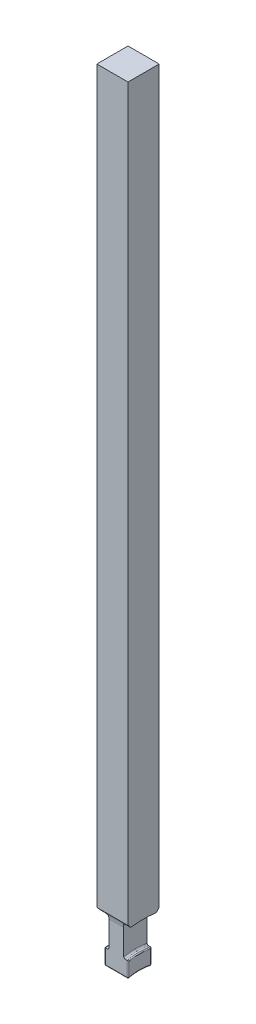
ISO-10303-21;
HEADER;
FILE_DESCRIPTION(('STEP AP214'),'2;1');
FILE_NAME('part.step','',(''),(''),'','','');
FILE_SCHEMA(('AUTOMOTIVE_DESIGN { 1 0 10303 214 1 1 1 1 }'));
ENDSEC;
DATA;
#1=APPLICATION_CONTEXT('core data for automotive mechanical design processes');
#2=APPLICATION_PROTOCOL_DEFINITION('international standard','automotive_design',2000,#1);
#3=PRODUCT_CONTEXT('',#1,'mechanical');
#4=PRODUCT('Part','Part','',(#3));
#5=PRODUCT_RELATED_PRODUCT_CATEGORY('part','',(#4));
#6=PRODUCT_DEFINITION_FORMATION('','',#4);
#7=PRODUCT_DEFINITION_CONTEXT('part definition',#1,'design');
#8=PRODUCT_DEFINITION('design','',#6,#7);
#9=PRODUCT_DEFINITION_SHAPE('','',#8);
#10=(LENGTH_UNIT() NAMED_UNIT(*) SI_UNIT(.MILLI.,.METRE.));
#11=(NAMED_UNIT(*) PLANE_ANGLE_UNIT() SI_UNIT($,.RADIAN.));
#12=(NAMED_UNIT(*) SI_UNIT($,.STERADIAN.) SOLID_ANGLE_UNIT());
#13=UNCERTAINTY_MEASURE_WITH_UNIT(LENGTH_MEASURE(1.E-05),#10,'distance_accuracy_value','');
#14=(GEOMETRIC_REPRESENTATION_CONTEXT(3) GLOBAL_UNCERTAINTY_ASSIGNED_CONTEXT((#13)) GLOBAL_UNIT_ASSIGNED_CONTEXT((#10,
#11,#12)) REPRESENTATION_CONTEXT('',''));
#15=CARTESIAN_POINT('',(0.,0.,0.));
#16=DIRECTION('',(0.,0.,1.));
#17=DIRECTION('',(1.,0.,0.));
#18=AXIS2_PLACEMENT_3D('',#15,#16,#17);
#19=CARTESIAN_POINT('',(4.,212.,4.));
#20=DIRECTION('',(0.,0.,-1.));
#21=DIRECTION('',(0.,1.,0.));
#22=AXIS2_PLACEMENT_3D('',#19,#20,#21);
#23=PLANE('',#22);
#24=DIRECTION('',(0.,-1.,0.));
#25=VECTOR('',#24,1.);
#26=CARTESIAN_POINT('',(-4.,212.,4.));
#27=LINE('',#26,#25);
#28=CARTESIAN_POINT('',(-4.,212.,4.));
#29=VERTEX_POINT('',#28);
#30=CARTESIAN_POINT('',(-4.00000000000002,24.5553873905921,3.99999999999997));
#31=VERTEX_POINT('',#30);
#32=EDGE_CURVE('E247',#29,#31,#27,.T.);
#33=ORIENTED_EDGE('',*,*,#32,.T.);
#34=DIRECTION('',(1.,0.,0.));
#35=VECTOR('',#34,1.);
#36=CARTESIAN_POINT('',(-4.00000000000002,24.5553873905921,3.99999999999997));
#37=LINE('',#36,#35);
#38=CARTESIAN_POINT('',(4.00000000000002,24.5553873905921,3.99999999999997));
#39=VERTEX_POINT('',#38);
#40=EDGE_CURVE('E382',#31,#39,#37,.T.);
#41=ORIENTED_EDGE('',*,*,#40,.T.);
#42=DIRECTION('',(0.,-1.,0.));
#43=VECTOR('',#42,1.);
#44=CARTESIAN_POINT('',(4.,212.,4.));
#45=LINE('',#44,#43);
#46=CARTESIAN_POINT('',(4.,212.,4.));
#47=VERTEX_POINT('',#46);
#48=EDGE_CURVE('E237',#47,#39,#45,.T.);
#49=ORIENTED_EDGE('',*,*,#48,.F.);
#50=DIRECTION('',(-1.,0.,0.));
#51=VECTOR('',#50,1.);
#52=CARTESIAN_POINT('',(4.,212.,4.));
#53=LINE('',#52,#51);
#54=EDGE_CURVE('E228',#47,#29,#53,.T.);
#55=ORIENTED_EDGE('',*,*,#54,.T.);
#56=EDGE_LOOP('',(#33,#41,#49,#55));
#57=FACE_BOUND('',#56,.T.);
#58=ADVANCED_FACE('F37',(#57),#23,.F.);
#59=CARTESIAN_POINT('',(4.,212.,-4.));
#60=DIRECTION('',(0.,0.,1.));
#61=DIRECTION('',(0.,-1.,0.));
#62=AXIS2_PLACEMENT_3D('',#59,#60,#61);
#63=PLANE('',#62);
#64=DIRECTION('',(0.,1.,0.));
#65=VECTOR('',#64,1.);
#66=CARTESIAN_POINT('',(4.,212.,-4.));
#67=LINE('',#66,#65);
#68=CARTESIAN_POINT('',(4.00000000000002,24.5553873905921,-4.00000000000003));
#69=VERTEX_POINT('',#68);
#70=CARTESIAN_POINT('',(4.,212.,-4.));
#71=VERTEX_POINT('',#70);
#72=EDGE_CURVE('E259',#69,#71,#67,.T.);
#73=ORIENTED_EDGE('',*,*,#72,.F.);
#74=DIRECTION('',(1.,0.,0.));
#75=VECTOR('',#74,1.);
#76=CARTESIAN_POINT('',(-4.00000000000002,24.5553873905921,-4.00000000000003));
#77=LINE('',#76,#75);
#78=CARTESIAN_POINT('',(-4.00000000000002,24.5553873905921,-4.00000000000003));
#79=VERTEX_POINT('',#78);
#80=EDGE_CURVE('E413',#69,#79,#77,.F.);
#81=ORIENTED_EDGE('',*,*,#80,.T.);
#82=DIRECTION('',(0.,1.,0.));
#83=VECTOR('',#82,1.);
#84=CARTESIAN_POINT('',(-4.,212.,-4.));
#85=LINE('',#84,#83);
#86=CARTESIAN_POINT('',(-4.,212.,-4.));
#87=VERTEX_POINT('',#86);
#88=EDGE_CURVE('E257',#79,#87,#85,.T.);
#89=ORIENTED_EDGE('',*,*,#88,.T.);
#90=DIRECTION('',(-1.,0.,0.));
#91=VECTOR('',#90,1.);
#92=CARTESIAN_POINT('',(4.,212.,-4.));
#93=LINE('',#92,#91);
#94=EDGE_CURVE('E260',#71,#87,#93,.T.);
#95=ORIENTED_EDGE('',*,*,#94,.F.);
#96=EDGE_LOOP('',(#73,#81,#89,#95));
#97=FACE_BOUND('',#96,.T.);
#98=ADVANCED_FACE('F374',(#97),#63,.F.);
#99=CARTESIAN_POINT('',(-4.,0.,0.));
#100=DIRECTION('',(-1.,0.,0.));
#101=DIRECTION('',(0.,0.,1.));
#102=AXIS2_PLACEMENT_3D('',#99,#100,#101);
#103=PLANE('',#102);
#104=CARTESIAN_POINT('',(-4.00000000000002,22.6124,-5.3876));
#105=DIRECTION('',(1.,0.,0.));
#106=DIRECTION('',(0.,0.,1.));
#107=AXIS2_PLACEMENT_3D('',#104,#105,#106);
#108=CIRCLE('',#107,2.3876);
#109=CARTESIAN_POINT('',(-4.00000000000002,23.7719741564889,-3.3004915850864));
#110=VERTEX_POINT('',#109);
#111=EDGE_CURVE('E439',#79,#110,#108,.T.);
#112=ORIENTED_EDGE('',*,*,#111,.T.);
#113=CARTESIAN_POINT('',(-4.00000000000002,0.,0.));
#114=DIRECTION('',(-1.,0.,0.));
#115=DIRECTION('',(0.,0.,1.));
#116=AXIS2_PLACEMENT_3D('',#113,#114,#115);
#117=CIRCLE('',#116,24.);
#118=CARTESIAN_POINT('',(-4.00000000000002,23.7719741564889,3.3004915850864));
#119=VERTEX_POINT('',#118);
#120=EDGE_CURVE('E244',#119,#110,#117,.T.);
#121=ORIENTED_EDGE('',*,*,#120,.F.);
#122=CARTESIAN_POINT('',(-4.00000000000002,22.6124,5.3876));
#123=DIRECTION('',(1.,0.,0.));
#124=DIRECTION('',(0.,0.,-1.));
#125=AXIS2_PLACEMENT_3D('',#122,#123,#124);
#126=CIRCLE('',#125,2.3876);
#127=EDGE_CURVE('E238',#119,#31,#126,.T.);
#128=ORIENTED_EDGE('',*,*,#127,.T.);
#129=ORIENTED_EDGE('',*,*,#32,.F.);
#130=DIRECTION('',(0.,0.,1.));
#131=VECTOR('',#130,1.);
#132=CARTESIAN_POINT('',(-4.,212.,4.));
#133=LINE('',#132,#131);
#134=EDGE_CURVE('E243',#87,#29,#133,.T.);
#135=ORIENTED_EDGE('',*,*,#134,.F.);
#136=ORIENTED_EDGE('',*,*,#88,.F.);
#137=EDGE_LOOP('',(#112,#121,#128,#129,#135,#136));
#138=FACE_BOUND('',#137,.T.);
#139=ADVANCED_FACE('F371',(#138),#103,.T.);
#140=CARTESIAN_POINT('',(4.,212.,4.));
#141=DIRECTION('',(0.,-1.,0.));
#142=DIRECTION('',(0.,0.,-1.));
#143=AXIS2_PLACEMENT_3D('',#140,#141,#142);
#144=PLANE('',#143);
#145=ORIENTED_EDGE('',*,*,#134,.T.);
#146=ORIENTED_EDGE('',*,*,#54,.F.);
#147=DIRECTION('',(0.,0.,1.));
#148=VECTOR('',#147,1.);
#149=CARTESIAN_POINT('',(4.,212.,4.));
#150=LINE('',#149,#148);
#151=EDGE_CURVE('E255',#71,#47,#150,.T.);
#152=ORIENTED_EDGE('',*,*,#151,.F.);
#153=ORIENTED_EDGE('',*,*,#94,.T.);
#154=EDGE_LOOP('',(#145,#146,#152,#153));
#155=FACE_BOUND('',#154,.T.);
#156=ADVANCED_FACE('F311',(#155),#144,.F.);
#157=CARTESIAN_POINT('',(4.,0.,0.));
#158=DIRECTION('',(-1.,0.,0.));
#159=DIRECTION('',(0.,0.,1.));
#160=AXIS2_PLACEMENT_3D('',#157,#158,#159);
#161=PLANE('',#160);
#162=CARTESIAN_POINT('',(4.00000000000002,0.,0.));
#163=DIRECTION('',(-1.,0.,0.));
#164=DIRECTION('',(0.,0.,1.));
#165=AXIS2_PLACEMENT_3D('',#162,#163,#164);
#166=CIRCLE('',#165,24.);
#167=CARTESIAN_POINT('',(4.00000000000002,23.7719741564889,3.3004915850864));
#168=VERTEX_POINT('',#167);
#169=CARTESIAN_POINT('',(4.00000000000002,23.7719741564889,-3.3004915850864));
#170=VERTEX_POINT('',#169);
#171=EDGE_CURVE('E235',#168,#170,#166,.T.);
#172=ORIENTED_EDGE('',*,*,#171,.T.);
#173=CARTESIAN_POINT('',(4.00000000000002,22.6124,-5.3876));
#174=DIRECTION('',(1.,0.,0.));
#175=DIRECTION('',(0.,0.,1.));
#176=AXIS2_PLACEMENT_3D('',#173,#174,#175);
#177=CIRCLE('',#176,2.3876);
#178=EDGE_CURVE('E394',#69,#170,#177,.T.);
#179=ORIENTED_EDGE('',*,*,#178,.F.);
#180=ORIENTED_EDGE('',*,*,#72,.T.);
#181=ORIENTED_EDGE('',*,*,#151,.T.);
#182=ORIENTED_EDGE('',*,*,#48,.T.);
#183=CARTESIAN_POINT('',(4.00000000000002,22.6124,5.3876));
#184=DIRECTION('',(1.,0.,0.));
#185=DIRECTION('',(0.,0.,-1.));
#186=AXIS2_PLACEMENT_3D('',#183,#184,#185);
#187=CIRCLE('',#186,2.3876);
#188=EDGE_CURVE('E218',#168,#39,#187,.T.);
#189=ORIENTED_EDGE('',*,*,#188,.F.);
#190=EDGE_LOOP('',(#172,#179,#180,#181,#182,#189));
#191=FACE_BOUND('',#190,.T.);
#192=ADVANCED_FACE('F233',(#191),#161,.F.);
#193=CARTESIAN_POINT('',(-4.,0.,0.));
#194=DIRECTION('',(1.,0.,0.));
#195=DIRECTION('',(0.,0.,-1.));
#196=AXIS2_PLACEMENT_3D('',#193,#194,#195);
#197=CYLINDRICAL_SURFACE('',#196,12.);
#198=CARTESIAN_POINT('',(-2.746,0.,0.));
#199=DIRECTION('',(1.,0.,0.));
#200=DIRECTION('',(0.,1.,0.));
#201=AXIS2_PLACEMENT_3D('',#198,#199,#200);
#202=CIRCLE('',#201,12.);
#203=CARTESIAN_POINT('',(-2.746,11.6948211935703,2.68908111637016));
#204=VERTEX_POINT('',#203);
#205=CARTESIAN_POINT('',(-2.746,11.6948211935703,-2.68908111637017));
#206=VERTEX_POINT('',#205);
#207=EDGE_CURVE('E611',#204,#206,#202,.F.);
#208=ORIENTED_EDGE('',*,*,#207,.T.);
#209=DIRECTION('',(1.,0.,0.));
#210=VECTOR('',#209,1.);
#211=CARTESIAN_POINT('',(-4.,11.6948211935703,-2.68908111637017));
#212=LINE('',#211,#210);
#213=CARTESIAN_POINT('',(2.746,11.6948211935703,-2.68908111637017));
#214=VERTEX_POINT('',#213);
#215=EDGE_CURVE('E606',#206,#214,#212,.T.);
#216=ORIENTED_EDGE('',*,*,#215,.T.);
#217=CARTESIAN_POINT('',(2.746,0.,0.));
#218=DIRECTION('',(-1.,0.,0.));
#219=DIRECTION('',(0.,-1.,0.));
#220=AXIS2_PLACEMENT_3D('',#217,#218,#219);
#221=CIRCLE('',#220,12.);
#222=CARTESIAN_POINT('',(2.746,11.6948211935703,2.68908111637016));
#223=VERTEX_POINT('',#222);
#224=EDGE_CURVE('E608',#214,#223,#221,.F.);
#225=ORIENTED_EDGE('',*,*,#224,.T.);
#226=DIRECTION('',(1.,0.,0.));
#227=VECTOR('',#226,1.);
#228=CARTESIAN_POINT('',(-4.,11.6948211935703,2.68908111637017));
#229=LINE('',#228,#227);
#230=EDGE_CURVE('E613',#223,#204,#229,.F.);
#231=ORIENTED_EDGE('',*,*,#230,.T.);
#232=EDGE_LOOP('',(#208,#216,#225,#231));
#233=FACE_BOUND('',#232,.T.);
#234=ADVANCED_FACE('F358',(#233),#197,.F.);
#235=CARTESIAN_POINT('',(-1.905,16.,0.));
#236=DIRECTION('',(-1.,0.,0.));
#237=DIRECTION('',(0.,0.,1.));
#238=AXIS2_PLACEMENT_3D('',#235,#236,#237);
#239=PLANE('',#238);
#240=DIRECTION('',(0.,1.,0.));
#241=VECTOR('',#240,1.);
#242=CARTESIAN_POINT('',(-1.905,16.,-3.));
#243=LINE('',#242,#241);
#244=CARTESIAN_POINT('',(-1.905,16.1039486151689,-3.));
#245=VERTEX_POINT('',#244);
#246=CARTESIAN_POINT('',(-1.905,22.6124,-3.));
#247=VERTEX_POINT('',#246);
#248=EDGE_CURVE('E250',#245,#247,#243,.T.);
#249=ORIENTED_EDGE('',*,*,#248,.F.);
#250=CARTESIAN_POINT('',(-1.905,0.,0.));
#251=DIRECTION('',(-1.,0.,0.));
#252=DIRECTION('',(0.,0.,1.));
#253=AXIS2_PLACEMENT_3D('',#250,#251,#252);
#254=CIRCLE('',#253,16.381);
#255=CARTESIAN_POINT('',(-1.905,16.1039486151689,3.));
#256=VERTEX_POINT('',#255);
#257=EDGE_CURVE('E471',#245,#256,#254,.F.);
#258=ORIENTED_EDGE('',*,*,#257,.T.);
#259=DIRECTION('',(0.,-1.,0.));
#260=VECTOR('',#259,1.);
#261=CARTESIAN_POINT('',(-1.905,16.,3.));
#262=LINE('',#261,#260);
#263=CARTESIAN_POINT('',(-1.905,22.6124,3.));
#264=VERTEX_POINT('',#263);
#265=EDGE_CURVE('E421',#264,#256,#262,.T.);
#266=ORIENTED_EDGE('',*,*,#265,.F.);
#267=CARTESIAN_POINT('',(-1.905,22.6124,5.3876));
#268=DIRECTION('',(-1.,0.,0.));
#269=DIRECTION('',(0.,0.,1.));
#270=AXIS2_PLACEMENT_3D('',#267,#268,#269);
#271=CIRCLE('',#270,2.3876);
#272=CARTESIAN_POINT('',(-1.905,23.0385151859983,3.03833211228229));
#273=VERTEX_POINT('',#272);
#274=EDGE_CURVE('E403',#273,#264,#271,.T.);
#275=ORIENTED_EDGE('',*,*,#274,.F.);
#276=CARTESIAN_POINT('',(-1.905,0.,0.));
#277=DIRECTION('',(-1.,0.,0.));
#278=DIRECTION('',(0.,0.,1.));
#279=AXIS2_PLACEMENT_3D('',#276,#277,#278);
#280=CIRCLE('',#279,23.238);
#281=CARTESIAN_POINT('',(-1.905,23.0385151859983,-3.03833211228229));
#282=VERTEX_POINT('',#281);
#283=EDGE_CURVE('E275',#273,#282,#280,.T.);
#284=ORIENTED_EDGE('',*,*,#283,.T.);
#285=CARTESIAN_POINT('',(-1.905,22.6124,-5.3876));
#286=DIRECTION('',(-1.,0.,0.));
#287=DIRECTION('',(0.,0.,1.));
#288=AXIS2_PLACEMENT_3D('',#285,#286,#287);
#289=CIRCLE('',#288,2.3876);
#290=EDGE_CURVE('E410',#247,#282,#289,.T.);
#291=ORIENTED_EDGE('',*,*,#290,.F.);
#292=EDGE_LOOP('',(#249,#258,#266,#275,#284,#291));
#293=FACE_BOUND('',#292,.T.);
#294=ADVANCED_FACE('F354',(#293),#239,.T.);
#295=CARTESIAN_POINT('',(-8.84822894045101,0.,0.));
#296=DIRECTION('',(-1.,0.,0.));
#297=DIRECTION('',(0.,0.,1.));
#298=AXIS2_PLACEMENT_3D('',#295,#296,#297);
#299=CYLINDRICAL_SURFACE('',#298,24.);
#300=DIRECTION('',(1.,0.,0.));
#301=VECTOR('',#300,1.);
#302=CARTESIAN_POINT('',(-2.95250000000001,23.7719741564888,-3.3004915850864));
#303=LINE('',#302,#301);
#304=CARTESIAN_POINT('',(-2.667,23.7719741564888,-3.3004915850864));
#305=VERTEX_POINT('',#304);
#306=EDGE_CURVE('E408',#305,#110,#303,.F.);
#307=ORIENTED_EDGE('',*,*,#306,.F.);
#308=CARTESIAN_POINT('',(-2.667,0.,0.));
#309=DIRECTION('',(-1.,0.,0.));
#310=DIRECTION('',(0.,0.,1.));
#311=AXIS2_PLACEMENT_3D('',#308,#309,#310);
#312=CIRCLE('',#311,24.);
#313=CARTESIAN_POINT('',(-2.667,23.7719741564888,3.3004915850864));
#314=VERTEX_POINT('',#313);
#315=EDGE_CURVE('E278',#305,#314,#312,.F.);
#316=ORIENTED_EDGE('',*,*,#315,.T.);
#317=DIRECTION('',(1.,0.,0.));
#318=VECTOR('',#317,1.);
#319=CARTESIAN_POINT('',(-2.95250000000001,23.7719741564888,3.3004915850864));
#320=LINE('',#319,#318);
#321=EDGE_CURVE('E400',#119,#314,#320,.T.);
#322=ORIENTED_EDGE('',*,*,#321,.F.);
#323=ORIENTED_EDGE('',*,*,#120,.T.);
#324=EDGE_LOOP('',(#307,#316,#322,#323));
#325=FACE_BOUND('',#324,.T.);
#326=ADVANCED_FACE('F357',(#325),#299,.F.);
#327=CARTESIAN_POINT('',(-8.84822894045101,0.,0.));
#328=DIRECTION('',(-1.,0.,0.));
#329=DIRECTION('',(0.,0.,1.));
#330=AXIS2_PLACEMENT_3D('',#327,#328,#329);
#331=CYLINDRICAL_SURFACE('',#330,16.);
#332=DIRECTION('',(-1.,0.,0.));
#333=VECTOR('',#332,1.);
#334=CARTESIAN_POINT('',(-8.84822894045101,15.7162336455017,-3.));
#335=LINE('',#334,#333);
#336=CARTESIAN_POINT('',(-2.746,15.7162336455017,-3.));
#337=VERTEX_POINT('',#336);
#338=CARTESIAN_POINT('',(-2.286,15.7162336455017,-3.));
#339=VERTEX_POINT('',#338);
#340=EDGE_CURVE('E426',#337,#339,#335,.F.);
#341=ORIENTED_EDGE('',*,*,#340,.F.);
#342=CARTESIAN_POINT('',(-2.746,0.,0.));
#343=DIRECTION('',(1.,0.,0.));
#344=DIRECTION('',(0.,1.,0.));
#345=AXIS2_PLACEMENT_3D('',#342,#343,#344);
#346=CIRCLE('',#345,16.);
#347=CARTESIAN_POINT('',(-2.746,15.7162336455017,3.));
#348=VERTEX_POINT('',#347);
#349=EDGE_CURVE('E11',#337,#348,#346,.T.);
#350=ORIENTED_EDGE('',*,*,#349,.T.);
#351=DIRECTION('',(-1.,0.,0.));
#352=VECTOR('',#351,1.);
#353=CARTESIAN_POINT('',(-8.84822894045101,15.7162336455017,3.));
#354=LINE('',#353,#352);
#355=CARTESIAN_POINT('',(-2.286,15.7162336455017,3.));
#356=VERTEX_POINT('',#355);
#357=EDGE_CURVE('E418',#356,#348,#354,.T.);
#358=ORIENTED_EDGE('',*,*,#357,.F.);
#359=CARTESIAN_POINT('',(-2.286,0.,0.));
#360=DIRECTION('',(-1.,0.,0.));
#361=DIRECTION('',(0.,0.,1.));
#362=AXIS2_PLACEMENT_3D('',#359,#360,#361);
#363=CIRCLE('',#362,16.);
#364=EDGE_CURVE('E333',#356,#339,#363,.T.);
#365=ORIENTED_EDGE('',*,*,#364,.T.);
#366=EDGE_LOOP('',(#341,#350,#358,#365));
#367=FACE_BOUND('',#366,.T.);
#368=ADVANCED_FACE('F349',(#367),#331,.T.);
#369=CARTESIAN_POINT('',(1.905,16.,0.));
#370=DIRECTION('',(1.,0.,0.));
#371=DIRECTION('',(0.,0.,-1.));
#372=AXIS2_PLACEMENT_3D('',#369,#370,#371);
#373=PLANE('',#372);
#374=DIRECTION('',(0.,1.,0.));
#375=VECTOR('',#374,1.);
#376=CARTESIAN_POINT('',(1.905,16.,3.));
#377=LINE('',#376,#375);
#378=CARTESIAN_POINT('',(1.905,16.1039486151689,3.));
#379=VERTEX_POINT('',#378);
#380=CARTESIAN_POINT('',(1.905,22.6124,3.));
#381=VERTEX_POINT('',#380);
#382=EDGE_CURVE('E416',#379,#381,#377,.T.);
#383=ORIENTED_EDGE('',*,*,#382,.F.);
#384=CARTESIAN_POINT('',(1.905,0.,0.));
#385=DIRECTION('',(1.,0.,0.));
#386=DIRECTION('',(0.,0.,-1.));
#387=AXIS2_PLACEMENT_3D('',#384,#385,#386);
#388=CIRCLE('',#387,16.381);
#389=CARTESIAN_POINT('',(1.905,16.1039486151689,-3.));
#390=VERTEX_POINT('',#389);
#391=EDGE_CURVE('E452',#379,#390,#388,.F.);
#392=ORIENTED_EDGE('',*,*,#391,.T.);
#393=DIRECTION('',(0.,-1.,0.));
#394=VECTOR('',#393,1.);
#395=CARTESIAN_POINT('',(1.905,16.,-3.));
#396=LINE('',#395,#394);
#397=CARTESIAN_POINT('',(1.905,22.6124,-3.));
#398=VERTEX_POINT('',#397);
#399=EDGE_CURVE('E424',#398,#390,#396,.T.);
#400=ORIENTED_EDGE('',*,*,#399,.F.);
#401=CARTESIAN_POINT('',(1.905,22.6124,-5.3876));
#402=DIRECTION('',(1.,0.,0.));
#403=DIRECTION('',(0.,0.,-1.));
#404=AXIS2_PLACEMENT_3D('',#401,#402,#403);
#405=CIRCLE('',#404,2.3876);
#406=CARTESIAN_POINT('',(1.905,23.0385151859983,-3.03833211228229));
#407=VERTEX_POINT('',#406);
#408=EDGE_CURVE('E406',#407,#398,#405,.T.);
#409=ORIENTED_EDGE('',*,*,#408,.F.);
#410=CARTESIAN_POINT('',(1.905,0.,0.));
#411=DIRECTION('',(1.,0.,0.));
#412=DIRECTION('',(0.,0.,-1.));
#413=AXIS2_PLACEMENT_3D('',#410,#411,#412);
#414=CIRCLE('',#413,23.238);
#415=CARTESIAN_POINT('',(1.905,23.0385151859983,3.03833211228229));
#416=VERTEX_POINT('',#415);
#417=EDGE_CURVE('E282',#407,#416,#414,.T.);
#418=ORIENTED_EDGE('',*,*,#417,.T.);
#419=CARTESIAN_POINT('',(1.905,22.6124,5.3876));
#420=DIRECTION('',(1.,0.,0.));
#421=DIRECTION('',(0.,0.,-1.));
#422=AXIS2_PLACEMENT_3D('',#419,#420,#421);
#423=CIRCLE('',#422,2.3876);
#424=EDGE_CURVE('E398',#381,#416,#423,.T.);
#425=ORIENTED_EDGE('',*,*,#424,.F.);
#426=EDGE_LOOP('',(#383,#392,#400,#409,#418,#425));
#427=FACE_BOUND('',#426,.T.);
#428=ADVANCED_FACE('F346',(#427),#373,.T.);
#429=CARTESIAN_POINT('',(-8.84822894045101,0.,0.));
#430=DIRECTION('',(-1.,0.,0.));
#431=DIRECTION('',(0.,0.,1.));
#432=AXIS2_PLACEMENT_3D('',#429,#430,#431);
#433=CYLINDRICAL_SURFACE('',#432,16.);
#434=DIRECTION('',(-1.,0.,0.));
#435=VECTOR('',#434,1.);
#436=CARTESIAN_POINT('',(-8.84822894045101,15.7162336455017,3.));
#437=LINE('',#436,#435);
#438=CARTESIAN_POINT('',(2.746,15.7162336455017,3.));
#439=VERTEX_POINT('',#438);
#440=CARTESIAN_POINT('',(2.286,15.7162336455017,3.));
#441=VERTEX_POINT('',#440);
#442=EDGE_CURVE('E270',#439,#441,#437,.T.);
#443=ORIENTED_EDGE('',*,*,#442,.F.);
#444=CARTESIAN_POINT('',(2.746,0.,0.));
#445=DIRECTION('',(-1.,0.,0.));
#446=DIRECTION('',(0.,-1.,0.));
#447=AXIS2_PLACEMENT_3D('',#444,#445,#446);
#448=CIRCLE('',#447,16.);
#449=CARTESIAN_POINT('',(2.746,15.7162336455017,-3.));
#450=VERTEX_POINT('',#449);
#451=EDGE_CURVE('E467',#439,#450,#448,.T.);
#452=ORIENTED_EDGE('',*,*,#451,.T.);
#453=DIRECTION('',(-1.,0.,0.));
#454=VECTOR('',#453,1.);
#455=CARTESIAN_POINT('',(-8.84822894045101,15.7162336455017,-3.));
#456=LINE('',#455,#454);
#457=CARTESIAN_POINT('',(2.286,15.7162336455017,-3.));
#458=VERTEX_POINT('',#457);
#459=EDGE_CURVE('E272',#458,#450,#456,.F.);
#460=ORIENTED_EDGE('',*,*,#459,.F.);
#461=CARTESIAN_POINT('',(2.286,0.,0.));
#462=DIRECTION('',(1.,0.,0.));
#463=DIRECTION('',(0.,0.,-1.));
#464=AXIS2_PLACEMENT_3D('',#461,#462,#463);
#465=CIRCLE('',#464,16.);
#466=EDGE_CURVE('E464',#458,#441,#465,.T.);
#467=ORIENTED_EDGE('',*,*,#466,.T.);
#468=EDGE_LOOP('',(#443,#452,#460,#467));
#469=FACE_BOUND('',#468,.T.);
#470=ADVANCED_FACE('F345',(#469),#433,.T.);
#471=CARTESIAN_POINT('',(-8.84822894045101,0.,0.));
#472=DIRECTION('',(-1.,0.,0.));
#473=DIRECTION('',(0.,0.,1.));
#474=AXIS2_PLACEMENT_3D('',#471,#472,#473);
#475=CYLINDRICAL_SURFACE('',#474,24.);
#476=DIRECTION('',(1.,0.,0.));
#477=VECTOR('',#476,1.);
#478=CARTESIAN_POINT('',(2.95250000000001,23.7719741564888,3.3004915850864));
#479=LINE('',#478,#477);
#480=CARTESIAN_POINT('',(2.667,23.7719741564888,3.3004915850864));
#481=VERTEX_POINT('',#480);
#482=EDGE_CURVE('E215',#481,#168,#479,.T.);
#483=ORIENTED_EDGE('',*,*,#482,.F.);
#484=CARTESIAN_POINT('',(2.667,0.,0.));
#485=DIRECTION('',(1.,0.,0.));
#486=DIRECTION('',(0.,0.,-1.));
#487=AXIS2_PLACEMENT_3D('',#484,#485,#486);
#488=CIRCLE('',#487,24.);
#489=CARTESIAN_POINT('',(2.667,23.7719741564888,-3.3004915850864));
#490=VERTEX_POINT('',#489);
#491=EDGE_CURVE('E280',#481,#490,#488,.F.);
#492=ORIENTED_EDGE('',*,*,#491,.T.);
#493=DIRECTION('',(1.,0.,0.));
#494=VECTOR('',#493,1.);
#495=CARTESIAN_POINT('',(2.95250000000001,23.7719741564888,-3.3004915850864));
#496=LINE('',#495,#494);
#497=EDGE_CURVE('E227',#170,#490,#496,.F.);
#498=ORIENTED_EDGE('',*,*,#497,.F.);
#499=ORIENTED_EDGE('',*,*,#171,.F.);
#500=EDGE_LOOP('',(#483,#492,#498,#499));
#501=FACE_BOUND('',#500,.T.);
#502=ADVANCED_FACE('F241',(#501),#475,.F.);
#503=CARTESIAN_POINT('',(-4.00000000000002,0.,3.));
#504=DIRECTION('',(0.,0.,-1.));
#505=DIRECTION('',(0.,1.,0.));
#506=AXIS2_PLACEMENT_3D('',#503,#504,#505);
#507=PLANE('',#506);
#508=DIRECTION('',(1.,0.,0.));
#509=VECTOR('',#508,1.);
#510=CARTESIAN_POINT('',(-4.00000000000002,11.9423615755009,3.));
#511=LINE('',#510,#509);
#512=CARTESIAN_POINT('',(-2.746,11.9423615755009,3.));
#513=VERTEX_POINT('',#512);
#514=CARTESIAN_POINT('',(2.746,11.9423615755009,3.));
#515=VERTEX_POINT('',#514);
#516=EDGE_CURVE('E604',#513,#515,#511,.T.);
#517=ORIENTED_EDGE('',*,*,#516,.T.);
#518=DIRECTION('',(0.,1.,0.));
#519=VECTOR('',#518,1.);
#520=CARTESIAN_POINT('',(2.746,0.,3.));
#521=LINE('',#520,#519);
#522=EDGE_CURVE('E601',#515,#439,#521,.T.);
#523=ORIENTED_EDGE('',*,*,#522,.T.);
#524=ORIENTED_EDGE('',*,*,#442,.T.);
#525=CARTESIAN_POINT('',(2.286,15.7162336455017,3.));
#526=CARTESIAN_POINT('',(2.26483852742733,15.7162138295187,3.));
#527=CARTESIAN_POINT('',(2.24368479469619,15.7180272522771,3.));
#528=CARTESIAN_POINT('',(2.20200688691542,15.7251715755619,3.));
#529=CARTESIAN_POINT('',(2.18148193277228,15.7304979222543,3.));
#530=CARTESIAN_POINT('',(2.14161183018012,15.7445219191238,3.));
#531=CARTESIAN_POINT('',(2.12226704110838,15.7532205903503,3.));
#532=CARTESIAN_POINT('',(2.08529777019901,15.7737154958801,3.));
#533=CARTESIAN_POINT('',(2.06767323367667,15.7855116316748,3.));
#534=CARTESIAN_POINT('',(2.03448598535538,15.8119557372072,3.));
#535=CARTESIAN_POINT('',(2.01894051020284,15.8266253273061,3.));
#536=CARTESIAN_POINT('',(1.99048101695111,15.8583304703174,3.));
#537=CARTESIAN_POINT('',(1.97756759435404,15.875366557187,3.));
#538=CARTESIAN_POINT('',(1.95451065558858,15.9116241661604,3.));
#539=CARTESIAN_POINT('',(1.94441753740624,15.9308777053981,3.));
#540=CARTESIAN_POINT('',(1.92755440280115,15.9707855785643,3.));
#541=CARTESIAN_POINT('',(1.92078322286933,15.9914394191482,3.));
#542=CARTESIAN_POINT('',(1.91218275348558,16.0274736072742,3.));
#543=CARTESIAN_POINT('',(1.90949097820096,16.0426541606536,3.));
#544=CARTESIAN_POINT('',(1.90589964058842,16.0732042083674,3.));
#545=CARTESIAN_POINT('',(1.90499757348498,16.088573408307,3.));
#546=CARTESIAN_POINT('',(1.905,16.1039486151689,3.));
#547=B_SPLINE_CURVE_WITH_KNOTS('',3,(#525,#526,#527,#528,#529,#530,#531,#532,#533,#534,#535,
#536,#537,#538,#539,#540,#541,#542,#543,#544,#545,#546),.UNSPECIFIED.,.F.,.F.,(4,2,2,2,2,2,2,2,
2,2,4),(0.,0.0633953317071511,0.126708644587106,0.190041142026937,0.253371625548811,
0.317198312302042,0.381039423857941,0.445957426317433,0.510852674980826,0.557004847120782,
0.603092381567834),.UNSPECIFIED.);
#548=EDGE_CURVE('E459',#441,#379,#547,.T.);
#549=ORIENTED_EDGE('',*,*,#548,.T.);
#550=ORIENTED_EDGE('',*,*,#382,.T.);
#551=DIRECTION('',(1.,0.,0.));
#552=VECTOR('',#551,1.);
#553=CARTESIAN_POINT('',(-4.00000000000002,22.6124,3.));
#554=LINE('',#553,#552);
#555=EDGE_CURVE('E391',#264,#381,#554,.T.);
#556=ORIENTED_EDGE('',*,*,#555,.F.);
#557=ORIENTED_EDGE('',*,*,#265,.T.);
#558=CARTESIAN_POINT('',(-1.905,16.1039486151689,3.));
#559=CARTESIAN_POINT('',(-1.90498313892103,16.0818581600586,3.));
#560=CARTESIAN_POINT('',(-1.90685583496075,16.0597712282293,3.));
#561=CARTESIAN_POINT('',(-1.91425675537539,16.0162247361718,3.));
#562=CARTESIAN_POINT('',(-1.91978390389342,15.9947649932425,3.));
#563=CARTESIAN_POINT('',(-1.93437489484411,15.9530662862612,3.));
#564=CARTESIAN_POINT('',(-1.94344097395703,15.9328281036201,3.));
#565=CARTESIAN_POINT('',(-1.96486395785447,15.8941821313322,3.));
#566=CARTESIAN_POINT('',(-1.9772198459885,15.8757737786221,3.));
#567=CARTESIAN_POINT('',(-2.00478592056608,15.8414646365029,3.));
#568=CARTESIAN_POINT('',(-2.01997366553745,15.8255458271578,3.));
#569=CARTESIAN_POINT('',(-2.05285036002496,15.7965326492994,3.));
#570=CARTESIAN_POINT('',(-2.07053969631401,15.7834387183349,3.));
#571=CARTESIAN_POINT('',(-2.10760244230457,15.7606829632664,3.));
#572=CARTESIAN_POINT('',(-2.12694358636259,15.7509685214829,3.));
#573=CARTESIAN_POINT('',(-2.16699486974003,15.734991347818,3.));
#574=CARTESIAN_POINT('',(-2.18770383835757,15.7287257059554,3.));
#575=CARTESIAN_POINT('',(-2.22147725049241,15.7216077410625,3.));
#576=CARTESIAN_POINT('',(-2.23430798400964,15.7195936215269,3.));
#577=CARTESIAN_POINT('',(-2.26009046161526,15.7169069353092,3.));
#578=CARTESIAN_POINT('',(-2.27304200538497,15.7162324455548,3.));
#579=CARTESIAN_POINT('',(-2.28599999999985,15.716233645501,3.));
#580=B_SPLINE_CURVE_WITH_KNOTS('',3,(#558,#559,#560,#561,#562,#563,#564,#565,#566,#567,#568,
#569,#570,#571,#572,#573,#574,#575,#576,#577,#578,#579),.UNSPECIFIED.,.F.,.F.,(4,2,2,2,2,2,2,2,
2,2,4),(0.,0.0661875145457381,0.132355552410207,0.198565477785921,0.264754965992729,
0.330440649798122,0.396136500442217,0.460758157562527,0.525325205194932,0.564224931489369,
0.603068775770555),.UNSPECIFIED.);
#581=EDGE_CURVE('E460',#256,#356,#580,.T.);
#582=ORIENTED_EDGE('',*,*,#581,.T.);
#583=ORIENTED_EDGE('',*,*,#357,.T.);
#584=DIRECTION('',(0.,-1.,0.));
#585=VECTOR('',#584,1.);
#586=CARTESIAN_POINT('',(-2.746,0.,3.));
#587=LINE('',#586,#585);
#588=EDGE_CURVE('E594',#348,#513,#587,.T.);
#589=ORIENTED_EDGE('',*,*,#588,.T.);
#590=EDGE_LOOP('',(#517,#523,#524,#549,#550,#556,#557,#582,#583,#589));
#591=FACE_BOUND('',#590,.T.);
#592=ADVANCED_FACE('F340',(#591),#507,.F.);
#593=CARTESIAN_POINT('',(-4.00000000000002,22.6124,5.3876));
#594=DIRECTION('',(1.,0.,0.));
#595=DIRECTION('',(0.,0.,-1.));
#596=AXIS2_PLACEMENT_3D('',#593,#594,#595);
#597=CYLINDRICAL_SURFACE('',#596,2.3876);
#598=ORIENTED_EDGE('',*,*,#127,.F.);
#599=ORIENTED_EDGE('',*,*,#321,.T.);
#600=CARTESIAN_POINT('',(-2.667,23.7719741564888,3.3004915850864));
#601=CARTESIAN_POINT('',(-2.62570561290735,23.7720095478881,3.30054623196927));
#602=CARTESIAN_POINT('',(-2.58445319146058,23.7688309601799,3.29874524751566));
#603=CARTESIAN_POINT('',(-2.50330653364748,23.7563407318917,3.29186100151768));
#604=CARTESIAN_POINT('',(-2.46340816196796,23.7470499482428,3.28678890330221));
#605=CARTESIAN_POINT('',(-2.38597312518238,23.7226345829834,3.27379029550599));
#606=CARTESIAN_POINT('',(-2.34843495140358,23.7075137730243,3.26586563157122));
#607=CARTESIAN_POINT('',(-2.27656689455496,23.6718664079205,3.24784175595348));
#608=CARTESIAN_POINT('',(-2.24223932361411,23.651335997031,3.23774099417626));
#609=CARTESIAN_POINT('',(-2.17626612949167,23.6044267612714,3.21568550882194));
#610=CARTESIAN_POINT('',(-2.14478322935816,23.5778464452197,3.20367268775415));
#611=CARTESIAN_POINT('',(-2.08683665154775,23.5199347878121,3.17897949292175));
#612=CARTESIAN_POINT('',(-2.06037440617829,23.4886020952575,3.16629892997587));
#613=CARTESIAN_POINT('',(-2.01221432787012,23.4205459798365,3.14062306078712));
#614=CARTESIAN_POINT('',(-1.99074076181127,23.3836607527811,3.12763459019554));
#615=CARTESIAN_POINT('',(-1.95461834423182,23.306376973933,3.10272069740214));
#616=CARTESIAN_POINT('',(-1.93996308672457,23.2659817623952,3.09079428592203));
#617=CARTESIAN_POINT('',(-1.92106478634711,23.194342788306,3.07179723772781));
#618=CARTESIAN_POINT('',(-1.91506150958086,23.1636666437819,3.064297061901));
#619=CARTESIAN_POINT('',(-1.90702361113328,23.1015463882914,3.05042273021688));
#620=CARTESIAN_POINT('',(-1.90498954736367,23.0701021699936,3.04404873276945));
#621=CARTESIAN_POINT('',(-1.905,23.0385151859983,3.03833211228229));
#622=B_SPLINE_CURVE_WITH_KNOTS('',3,(#600,#601,#602,#603,#604,#605,#606,#607,#608,#609,#610,
#611,#612,#613,#614,#615,#616,#617,#618,#619,#620,#621),.UNSPECIFIED.,.F.,.F.,(4,2,2,2,2,2,2,2,
2,2,4),(0.,0.123656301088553,0.246892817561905,0.370049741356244,0.493294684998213,
0.621481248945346,0.749704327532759,0.882894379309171,1.01595904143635,1.11213377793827,
1.20832203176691),.UNSPECIFIED.);
#623=EDGE_CURVE('E292',#314,#273,#622,.T.);
#624=ORIENTED_EDGE('',*,*,#623,.T.);
#625=ORIENTED_EDGE('',*,*,#274,.T.);
#626=ORIENTED_EDGE('',*,*,#555,.T.);
#627=ORIENTED_EDGE('',*,*,#424,.T.);
#628=CARTESIAN_POINT('',(1.905,23.0385151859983,3.03833211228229));
#629=CARTESIAN_POINT('',(1.90496142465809,23.0800496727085,3.04582495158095));
#630=CARTESIAN_POINT('',(1.90849535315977,23.1213303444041,3.054489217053));
#631=CARTESIAN_POINT('',(1.92233286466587,23.2021835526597,3.07362964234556));
#632=CARTESIAN_POINT('',(1.93261685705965,23.2417606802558,3.08410049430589));
#633=CARTESIAN_POINT('',(1.95957545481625,23.3182371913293,3.10636596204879));
#634=CARTESIAN_POINT('',(1.97624644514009,23.3551380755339,3.11815982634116));
#635=CARTESIAN_POINT('',(2.01545075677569,23.4254662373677,3.14239644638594));
#636=CARTESIAN_POINT('',(2.03798759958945,23.4588914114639,3.15483958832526));
#637=CARTESIAN_POINT('',(2.08919258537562,23.5226220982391,3.18003450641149));
#638=CARTESIAN_POINT('',(2.11804373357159,23.5527822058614,3.19278232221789));
#639=CARTESIAN_POINT('',(2.18068244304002,23.607972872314,3.21725869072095));
#640=CARTESIAN_POINT('',(2.21447129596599,23.633002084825,3.22898697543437));
#641=CARTESIAN_POINT('',(2.28692923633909,23.6777883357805,3.25072942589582));
#642=CARTESIAN_POINT('',(2.32568491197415,23.6974254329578,3.26070305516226));
#643=CARTESIAN_POINT('',(2.40645623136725,23.7301228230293,3.27770155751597));
#644=CARTESIAN_POINT('',(2.44846773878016,23.7431913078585,3.28473010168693));
#645=CARTESIAN_POINT('',(2.52011875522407,23.7591190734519,3.29338831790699));
#646=CARTESIAN_POINT('',(2.54921721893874,23.7639290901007,3.29603653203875));
#647=CARTESIAN_POINT('',(2.60787020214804,23.7703600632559,3.29959472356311));
#648=CARTESIAN_POINT('',(2.63742475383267,23.7719807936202,3.30050457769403));
#649=CARTESIAN_POINT('',(2.667,23.7719741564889,3.3004915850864));
#650=B_SPLINE_CURVE_WITH_KNOTS('',3,(#628,#629,#630,#631,#632,#633,#634,#635,#636,#637,#638,
#639,#640,#641,#642,#643,#644,#645,#646,#647,#648,#649),.UNSPECIFIED.,.F.,.F.,(4,2,2,2,2,2,2,2,
2,2,4),(0.,0.126389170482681,0.252413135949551,0.378365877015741,0.504394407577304,
0.634724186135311,0.765088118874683,0.898152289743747,1.03105009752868,1.11967330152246,
1.20830278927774),.UNSPECIFIED.);
#651=EDGE_CURVE('E222',#416,#481,#650,.T.);
#652=ORIENTED_EDGE('',*,*,#651,.T.);
#653=ORIENTED_EDGE('',*,*,#482,.T.);
#654=ORIENTED_EDGE('',*,*,#188,.T.);
#655=ORIENTED_EDGE('',*,*,#40,.F.);
#656=EDGE_LOOP('',(#598,#599,#624,#625,#626,#627,#652,#653,#654,#655));
#657=FACE_BOUND('',#656,.T.);
#658=ADVANCED_FACE('F217',(#657),#597,.F.);
#659=CARTESIAN_POINT('',(-4.00000000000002,0.,-3.));
#660=DIRECTION('',(0.,0.,1.));
#661=DIRECTION('',(1.,0.,0.));
#662=AXIS2_PLACEMENT_3D('',#659,#660,#661);
#663=PLANE('',#662);
#664=ORIENTED_EDGE('',*,*,#459,.T.);
#665=DIRECTION('',(0.,-1.,0.));
#666=VECTOR('',#665,1.);
#667=CARTESIAN_POINT('',(2.746,0.,-3.));
#668=LINE('',#667,#666);
#669=CARTESIAN_POINT('',(2.746,11.9423615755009,-3.));
#670=VERTEX_POINT('',#669);
#671=EDGE_CURVE('E624',#450,#670,#668,.T.);
#672=ORIENTED_EDGE('',*,*,#671,.T.);
#673=DIRECTION('',(1.,0.,0.));
#674=VECTOR('',#673,1.);
#675=CARTESIAN_POINT('',(-4.00000000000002,11.9423615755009,-3.));
#676=LINE('',#675,#674);
#677=CARTESIAN_POINT('',(-2.746,11.9423615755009,-3.));
#678=VERTEX_POINT('',#677);
#679=EDGE_CURVE('E627',#670,#678,#676,.F.);
#680=ORIENTED_EDGE('',*,*,#679,.T.);
#681=DIRECTION('',(0.,1.,0.));
#682=VECTOR('',#681,1.);
#683=CARTESIAN_POINT('',(-2.746,0.,-3.));
#684=LINE('',#683,#682);
#685=EDGE_CURVE('E626',#678,#337,#684,.T.);
#686=ORIENTED_EDGE('',*,*,#685,.T.);
#687=ORIENTED_EDGE('',*,*,#340,.T.);
#688=CARTESIAN_POINT('',(-2.286,15.7162336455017,-3.));
#689=CARTESIAN_POINT('',(-2.26483852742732,15.7162138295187,-3.));
#690=CARTESIAN_POINT('',(-2.24368479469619,15.7180272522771,-3.));
#691=CARTESIAN_POINT('',(-2.20200688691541,15.7251715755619,-3.));
#692=CARTESIAN_POINT('',(-2.18148193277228,15.7304979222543,-3.));
#693=CARTESIAN_POINT('',(-2.14161183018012,15.7445219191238,-3.));
#694=CARTESIAN_POINT('',(-2.12226704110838,15.7532205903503,-3.));
#695=CARTESIAN_POINT('',(-2.08529777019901,15.7737154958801,-3.));
#696=CARTESIAN_POINT('',(-2.06767323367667,15.7855116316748,-3.));
#697=CARTESIAN_POINT('',(-2.03448598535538,15.8119557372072,-3.));
#698=CARTESIAN_POINT('',(-2.01894051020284,15.8266253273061,-3.));
#699=CARTESIAN_POINT('',(-1.99048101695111,15.8583304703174,-3.));
#700=CARTESIAN_POINT('',(-1.97756759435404,15.875366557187,-3.));
#701=CARTESIAN_POINT('',(-1.95451065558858,15.9116241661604,-3.));
#702=CARTESIAN_POINT('',(-1.94441753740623,15.9308777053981,-3.));
#703=CARTESIAN_POINT('',(-1.92755440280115,15.9707855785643,-3.));
#704=CARTESIAN_POINT('',(-1.92078322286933,15.9914394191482,-3.));
#705=CARTESIAN_POINT('',(-1.91218275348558,16.0274736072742,-3.));
#706=CARTESIAN_POINT('',(-1.90949097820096,16.0426541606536,-3.));
#707=CARTESIAN_POINT('',(-1.90589964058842,16.0732042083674,-3.));
#708=CARTESIAN_POINT('',(-1.90499757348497,16.088573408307,-3.));
#709=CARTESIAN_POINT('',(-1.905,16.1039486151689,-3.));
#710=B_SPLINE_CURVE_WITH_KNOTS('',3,(#688,#689,#690,#691,#692,#693,#694,#695,#696,#697,#698,
#699,#700,#701,#702,#703,#704,#705,#706,#707,#708,#709),.UNSPECIFIED.,.F.,.F.,(4,2,2,2,2,2,2,2,
2,2,4),(0.,0.0633953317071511,0.126708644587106,0.190041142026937,0.253371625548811,
0.317198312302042,0.381039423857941,0.445957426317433,0.510852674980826,0.557004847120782,
0.603092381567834),.UNSPECIFIED.);
#711=EDGE_CURVE('E434',#339,#245,#710,.T.);
#712=ORIENTED_EDGE('',*,*,#711,.T.);
#713=ORIENTED_EDGE('',*,*,#248,.T.);
#714=DIRECTION('',(1.,0.,0.));
#715=VECTOR('',#714,1.);
#716=CARTESIAN_POINT('',(-4.00000000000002,22.6124,-3.));
#717=LINE('',#716,#715);
#718=EDGE_CURVE('E401',#247,#398,#717,.T.);
#719=ORIENTED_EDGE('',*,*,#718,.T.);
#720=ORIENTED_EDGE('',*,*,#399,.T.);
#721=CARTESIAN_POINT('',(1.905,16.1039486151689,-3.));
#722=CARTESIAN_POINT('',(1.90498313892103,16.0818581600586,-3.));
#723=CARTESIAN_POINT('',(1.90685583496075,16.0597712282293,-3.));
#724=CARTESIAN_POINT('',(1.91425675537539,16.0162247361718,-3.));
#725=CARTESIAN_POINT('',(1.91978390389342,15.9947649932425,-3.));
#726=CARTESIAN_POINT('',(1.93437489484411,15.9530662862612,-3.));
#727=CARTESIAN_POINT('',(1.94344097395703,15.9328281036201,-3.));
#728=CARTESIAN_POINT('',(1.96486395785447,15.8941821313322,-3.));
#729=CARTESIAN_POINT('',(1.97721984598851,15.8757737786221,-3.));
#730=CARTESIAN_POINT('',(2.00478592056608,15.8414646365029,-3.));
#731=CARTESIAN_POINT('',(2.01997366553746,15.8255458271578,-3.));
#732=CARTESIAN_POINT('',(2.05285036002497,15.7965326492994,-3.));
#733=CARTESIAN_POINT('',(2.07053969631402,15.7834387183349,-3.));
#734=CARTESIAN_POINT('',(2.10760244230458,15.7606829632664,-3.));
#735=CARTESIAN_POINT('',(2.12694358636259,15.7509685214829,-3.));
#736=CARTESIAN_POINT('',(2.16699486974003,15.734991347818,-3.));
#737=CARTESIAN_POINT('',(2.18770383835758,15.7287257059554,-3.));
#738=CARTESIAN_POINT('',(2.22147725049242,15.7216077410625,-3.));
#739=CARTESIAN_POINT('',(2.23430798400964,15.7195936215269,-3.));
#740=CARTESIAN_POINT('',(2.26009046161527,15.7169069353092,-3.));
#741=CARTESIAN_POINT('',(2.27304200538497,15.7162324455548,-3.));
#742=CARTESIAN_POINT('',(2.28599999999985,15.716233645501,-3.));
#743=B_SPLINE_CURVE_WITH_KNOTS('',3,(#721,#722,#723,#724,#725,#726,#727,#728,#729,#730,#731,
#732,#733,#734,#735,#736,#737,#738,#739,#740,#741,#742),.UNSPECIFIED.,.F.,.F.,(4,2,2,2,2,2,2,2,
2,2,4),(0.,0.0661875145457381,0.132355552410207,0.198565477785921,0.264754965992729,
0.330440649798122,0.396136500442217,0.460758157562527,0.525325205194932,0.564224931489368,
0.603068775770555),.UNSPECIFIED.);
#744=EDGE_CURVE('E453',#390,#458,#743,.T.);
#745=ORIENTED_EDGE('',*,*,#744,.T.);
#746=EDGE_LOOP('',(#664,#672,#680,#686,#687,#712,#713,#719,#720,#745));
#747=FACE_BOUND('',#746,.T.);
#748=ADVANCED_FACE('F339',(#747),#663,.F.);
#749=CARTESIAN_POINT('',(-4.00000000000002,22.6124,-5.3876));
#750=DIRECTION('',(1.,0.,0.));
#751=DIRECTION('',(0.,0.,-1.));
#752=AXIS2_PLACEMENT_3D('',#749,#750,#751);
#753=CYLINDRICAL_SURFACE('',#752,2.3876);
#754=ORIENTED_EDGE('',*,*,#178,.T.);
#755=ORIENTED_EDGE('',*,*,#497,.T.);
#756=CARTESIAN_POINT('',(2.667,23.7719741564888,-3.3004915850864));
#757=CARTESIAN_POINT('',(2.62570561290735,23.7720095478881,-3.30054623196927));
#758=CARTESIAN_POINT('',(2.58445319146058,23.7688309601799,-3.29874524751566));
#759=CARTESIAN_POINT('',(2.50330653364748,23.7563407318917,-3.29186100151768));
#760=CARTESIAN_POINT('',(2.46340816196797,23.7470499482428,-3.28678890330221));
#761=CARTESIAN_POINT('',(2.38597312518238,23.7226345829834,-3.27379029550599));
#762=CARTESIAN_POINT('',(2.34843495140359,23.7075137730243,-3.26586563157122));
#763=CARTESIAN_POINT('',(2.27656689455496,23.6718664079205,-3.24784175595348));
#764=CARTESIAN_POINT('',(2.24223932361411,23.651335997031,-3.23774099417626));
#765=CARTESIAN_POINT('',(2.17626612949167,23.6044267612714,-3.21568550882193));
#766=CARTESIAN_POINT('',(2.14478322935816,23.5778464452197,-3.20367268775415));
#767=CARTESIAN_POINT('',(2.08683665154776,23.5199347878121,-3.17897949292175));
#768=CARTESIAN_POINT('',(2.06037440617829,23.4886020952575,-3.16629892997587));
#769=CARTESIAN_POINT('',(2.01221432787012,23.4205459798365,-3.14062306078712));
#770=CARTESIAN_POINT('',(1.99074076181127,23.3836607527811,-3.12763459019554));
#771=CARTESIAN_POINT('',(1.95461834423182,23.306376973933,-3.10272069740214));
#772=CARTESIAN_POINT('',(1.93996308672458,23.2659817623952,-3.09079428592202));
#773=CARTESIAN_POINT('',(1.92106478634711,23.194342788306,-3.07179723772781));
#774=CARTESIAN_POINT('',(1.91506150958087,23.1636666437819,-3.064297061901));
#775=CARTESIAN_POINT('',(1.90702361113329,23.1015463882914,-3.05042273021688));
#776=CARTESIAN_POINT('',(1.90498954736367,23.0701021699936,-3.04404873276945));
#777=CARTESIAN_POINT('',(1.905,23.0385151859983,-3.03833211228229));
#778=B_SPLINE_CURVE_WITH_KNOTS('',3,(#756,#757,#758,#759,#760,#761,#762,#763,#764,#765,#766,
#767,#768,#769,#770,#771,#772,#773,#774,#775,#776,#777),.UNSPECIFIED.,.F.,.F.,(4,2,2,2,2,2,2,2,
2,2,4),(0.,0.123656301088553,0.246892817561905,0.370049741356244,0.493294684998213,
0.621481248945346,0.749704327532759,0.882894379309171,1.01595904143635,1.11213377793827,
1.20832203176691),.UNSPECIFIED.);
#779=EDGE_CURVE('E322',#490,#407,#778,.T.);
#780=ORIENTED_EDGE('',*,*,#779,.T.);
#781=ORIENTED_EDGE('',*,*,#408,.T.);
#782=ORIENTED_EDGE('',*,*,#718,.F.);
#783=ORIENTED_EDGE('',*,*,#290,.T.);
#784=CARTESIAN_POINT('',(-1.905,23.0385151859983,-3.03833211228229));
#785=CARTESIAN_POINT('',(-1.90496142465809,23.0800496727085,-3.04582495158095));
#786=CARTESIAN_POINT('',(-1.90849535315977,23.1213303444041,-3.054489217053));
#787=CARTESIAN_POINT('',(-1.92233286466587,23.2021835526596,-3.07362964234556));
#788=CARTESIAN_POINT('',(-1.93261685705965,23.2417606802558,-3.08410049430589));
#789=CARTESIAN_POINT('',(-1.95957545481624,23.3182371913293,-3.10636596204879));
#790=CARTESIAN_POINT('',(-1.97624644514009,23.3551380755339,-3.11815982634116));
#791=CARTESIAN_POINT('',(-2.01545075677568,23.4254662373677,-3.14239644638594));
#792=CARTESIAN_POINT('',(-2.03798759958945,23.4588914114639,-3.15483958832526));
#793=CARTESIAN_POINT('',(-2.08919258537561,23.5226220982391,-3.18003450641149));
#794=CARTESIAN_POINT('',(-2.11804373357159,23.5527822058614,-3.19278232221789));
#795=CARTESIAN_POINT('',(-2.18068244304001,23.607972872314,-3.21725869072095));
#796=CARTESIAN_POINT('',(-2.21447129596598,23.633002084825,-3.22898697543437));
#797=CARTESIAN_POINT('',(-2.28692923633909,23.6777883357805,-3.25072942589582));
#798=CARTESIAN_POINT('',(-2.32568491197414,23.6974254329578,-3.26070305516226));
#799=CARTESIAN_POINT('',(-2.40645623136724,23.7301228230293,-3.27770155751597));
#800=CARTESIAN_POINT('',(-2.44846773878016,23.7431913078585,-3.28473010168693));
#801=CARTESIAN_POINT('',(-2.52011875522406,23.7591190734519,-3.29338831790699));
#802=CARTESIAN_POINT('',(-2.54921721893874,23.7639290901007,-3.29603653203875));
#803=CARTESIAN_POINT('',(-2.60787020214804,23.7703600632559,-3.29959472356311));
#804=CARTESIAN_POINT('',(-2.63742475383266,23.7719807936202,-3.30050457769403));
#805=CARTESIAN_POINT('',(-2.667,23.7719741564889,-3.3004915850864));
#806=B_SPLINE_CURVE_WITH_KNOTS('',3,(#784,#785,#786,#787,#788,#789,#790,#791,#792,#793,#794,
#795,#796,#797,#798,#799,#800,#801,#802,#803,#804,#805),.UNSPECIFIED.,.F.,.F.,(4,2,2,2,2,2,2,2,
2,2,4),(0.,0.126389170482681,0.25241313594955,0.378365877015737,0.504394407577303,
0.634724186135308,0.76508811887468,0.898152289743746,1.03105009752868,1.11967330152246,
1.20830278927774),.UNSPECIFIED.);
#807=EDGE_CURVE('E284',#282,#305,#806,.T.);
#808=ORIENTED_EDGE('',*,*,#807,.T.);
#809=ORIENTED_EDGE('',*,*,#306,.T.);
#810=ORIENTED_EDGE('',*,*,#111,.F.);
#811=ORIENTED_EDGE('',*,*,#80,.F.);
#812=EDGE_LOOP('',(#754,#755,#780,#781,#782,#783,#808,#809,#810,#811));
#813=FACE_BOUND('',#812,.T.);
#814=ADVANCED_FACE('F299',(#813),#753,.F.);
#815=CARTESIAN_POINT('',(3.,16.,-4.00000000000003));
#816=DIRECTION('',(-1.,0.,0.));
#817=DIRECTION('',(0.,-1.,0.));
#818=AXIS2_PLACEMENT_3D('',#815,#816,#817);
#819=PLANE('',#818);
#820=CARTESIAN_POINT('',(3.,0.,0.));
#821=DIRECTION('',(-1.,0.,0.));
#822=DIRECTION('',(0.,-1.,0.));
#823=AXIS2_PLACEMENT_3D('',#820,#821,#822);
#824=CIRCLE('',#823,12.254);
#825=CARTESIAN_POINT('',(3.,11.9423615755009,2.746));
#826=VERTEX_POINT('',#825);
#827=CARTESIAN_POINT('',(3.,11.9423615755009,-2.746));
#828=VERTEX_POINT('',#827);
#829=EDGE_CURVE('E618',#826,#828,#824,.T.);
#830=ORIENTED_EDGE('',*,*,#829,.T.);
#831=DIRECTION('',(0.,-1.,0.));
#832=VECTOR('',#831,1.);
#833=CARTESIAN_POINT('',(3.,16.,-2.746));
#834=LINE('',#833,#832);
#835=CARTESIAN_POINT('',(3.,15.5047089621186,-2.746));
#836=VERTEX_POINT('',#835);
#837=EDGE_CURVE('E615',#828,#836,#834,.F.);
#838=ORIENTED_EDGE('',*,*,#837,.T.);
#839=CARTESIAN_POINT('',(3.,0.,0.));
#840=DIRECTION('',(-1.,0.,0.));
#841=DIRECTION('',(0.,-1.,0.));
#842=AXIS2_PLACEMENT_3D('',#839,#840,#841);
#843=CIRCLE('',#842,15.746);
#844=CARTESIAN_POINT('',(3.,15.5047089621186,2.746));
#845=VERTEX_POINT('',#844);
#846=EDGE_CURVE('E622',#836,#845,#843,.F.);
#847=ORIENTED_EDGE('',*,*,#846,.T.);
#848=DIRECTION('',(0.,1.,0.));
#849=VECTOR('',#848,1.);
#850=CARTESIAN_POINT('',(3.,16.,2.746));
#851=LINE('',#850,#849);
#852=EDGE_CURVE('E620',#845,#826,#851,.F.);
#853=ORIENTED_EDGE('',*,*,#852,.T.);
#854=EDGE_LOOP('',(#830,#838,#847,#853));
#855=FACE_BOUND('',#854,.T.);
#856=ADVANCED_FACE('F717',(#855),#819,.F.);
#857=CARTESIAN_POINT('',(-3.,16.,-4.00000000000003));
#858=DIRECTION('',(1.,0.,0.));
#859=DIRECTION('',(0.,1.,0.));
#860=AXIS2_PLACEMENT_3D('',#857,#858,#859);
#861=PLANE('',#860);
#862=CARTESIAN_POINT('',(-3.,0.,0.));
#863=DIRECTION('',(1.,0.,0.));
#864=DIRECTION('',(0.,1.,0.));
#865=AXIS2_PLACEMENT_3D('',#862,#863,#864);
#866=CIRCLE('',#865,12.254);
#867=CARTESIAN_POINT('',(-3.,11.9423615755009,-2.746));
#868=VERTEX_POINT('',#867);
#869=CARTESIAN_POINT('',(-3.,11.9423615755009,2.746));
#870=VERTEX_POINT('',#869);
#871=EDGE_CURVE('E60',#868,#870,#866,.T.);
#872=ORIENTED_EDGE('',*,*,#871,.T.);
#873=DIRECTION('',(0.,-1.,0.));
#874=VECTOR('',#873,1.);
#875=CARTESIAN_POINT('',(-3.,16.,2.746));
#876=LINE('',#875,#874);
#877=CARTESIAN_POINT('',(-3.,15.5047089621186,2.746));
#878=VERTEX_POINT('',#877);
#879=EDGE_CURVE('E52',#870,#878,#876,.F.);
#880=ORIENTED_EDGE('',*,*,#879,.T.);
#881=CARTESIAN_POINT('',(-3.,0.,0.));
#882=DIRECTION('',(1.,0.,0.));
#883=DIRECTION('',(0.,1.,0.));
#884=AXIS2_PLACEMENT_3D('',#881,#882,#883);
#885=CIRCLE('',#884,15.746);
#886=CARTESIAN_POINT('',(-3.,15.5047089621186,-2.746));
#887=VERTEX_POINT('',#886);
#888=EDGE_CURVE('E591',#878,#887,#885,.F.);
#889=ORIENTED_EDGE('',*,*,#888,.T.);
#890=DIRECTION('',(0.,1.,0.));
#891=VECTOR('',#890,1.);
#892=CARTESIAN_POINT('',(-3.,16.,-2.746));
#893=LINE('',#892,#891);
#894=EDGE_CURVE('E65',#887,#868,#893,.F.);
#895=ORIENTED_EDGE('',*,*,#894,.T.);
#896=EDGE_LOOP('',(#872,#880,#889,#895));
#897=FACE_BOUND('',#896,.T.);
#898=ADVANCED_FACE('F309',(#897),#861,.F.);
#899=CARTESIAN_POINT('',(-2.667,0.,0.));
#900=DIRECTION('',(-1.,0.,0.));
#901=DIRECTION('',(0.,0.,1.));
#902=AXIS2_PLACEMENT_3D('',#899,#900,#901);
#903=TOROIDAL_SURFACE('',#902,23.238,0.762);
#904=ORIENTED_EDGE('',*,*,#623,.F.);
#905=ORIENTED_EDGE('',*,*,#315,.F.);
#906=ORIENTED_EDGE('',*,*,#807,.F.);
#907=ORIENTED_EDGE('',*,*,#283,.F.);
#908=EDGE_LOOP('',(#904,#905,#906,#907));
#909=FACE_BOUND('',#908,.T.);
#910=ADVANCED_FACE('F303',(#909),#903,.F.);
#911=CARTESIAN_POINT('',(2.667,0.,0.));
#912=DIRECTION('',(1.,0.,0.));
#913=DIRECTION('',(0.,0.,-1.));
#914=AXIS2_PLACEMENT_3D('',#911,#912,#913);
#915=TOROIDAL_SURFACE('',#914,23.238,0.762);
#916=ORIENTED_EDGE('',*,*,#651,.F.);
#917=ORIENTED_EDGE('',*,*,#417,.F.);
#918=ORIENTED_EDGE('',*,*,#779,.F.);
#919=ORIENTED_EDGE('',*,*,#491,.F.);
#920=EDGE_LOOP('',(#916,#917,#918,#919));
#921=FACE_BOUND('',#920,.T.);
#922=ADVANCED_FACE('F308',(#921),#915,.F.);
#923=CARTESIAN_POINT('',(-2.286,0.,0.));
#924=DIRECTION('',(-1.,0.,0.));
#925=DIRECTION('',(0.,0.,1.));
#926=AXIS2_PLACEMENT_3D('',#923,#924,#925);
#927=TOROIDAL_SURFACE('',#926,16.381,0.381);
#928=ORIENTED_EDGE('',*,*,#581,.F.);
#929=ORIENTED_EDGE('',*,*,#257,.F.);
#930=ORIENTED_EDGE('',*,*,#711,.F.);
#931=ORIENTED_EDGE('',*,*,#364,.F.);
#932=EDGE_LOOP('',(#928,#929,#930,#931));
#933=FACE_BOUND('',#932,.T.);
#934=ADVANCED_FACE('F317',(#933),#927,.F.);
#935=CARTESIAN_POINT('',(2.286,0.,0.));
#936=DIRECTION('',(1.,0.,0.));
#937=DIRECTION('',(0.,0.,-1.));
#938=AXIS2_PLACEMENT_3D('',#935,#936,#937);
#939=TOROIDAL_SURFACE('',#938,16.381,0.381);
#940=ORIENTED_EDGE('',*,*,#548,.F.);
#941=ORIENTED_EDGE('',*,*,#466,.F.);
#942=ORIENTED_EDGE('',*,*,#744,.F.);
#943=ORIENTED_EDGE('',*,*,#391,.F.);
#944=EDGE_LOOP('',(#940,#941,#942,#943));
#945=FACE_BOUND('',#944,.T.);
#946=ADVANCED_FACE('F468',(#945),#939,.F.);
#947=CARTESIAN_POINT('',(-2.746,0.,2.746));
#948=DIRECTION('',(0.,-1.,0.));
#949=DIRECTION('',(0.,0.,-1.));
#950=AXIS2_PLACEMENT_3D('',#947,#948,#949);
#951=CYLINDRICAL_SURFACE('',#950,0.254);
#952=CARTESIAN_POINT('',(-2.746,11.9423615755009,2.746));
#953=DIRECTION('',(0.,-1.,0.));
#954=DIRECTION('',(1.,0.,0.));
#955=AXIS2_PLACEMENT_3D('',#952,#953,#954);
#956=CIRCLE('',#955,0.254);
#957=EDGE_CURVE('E578',#513,#870,#956,.T.);
#958=ORIENTED_EDGE('',*,*,#957,.F.);
#959=ORIENTED_EDGE('',*,*,#588,.F.);
#960=CARTESIAN_POINT('',(-2.746,15.7162336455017,3.));
#961=CARTESIAN_POINT('',(-2.75799051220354,15.7162488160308,3.00001854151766));
#962=CARTESIAN_POINT('',(-2.76995832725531,15.7155324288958,2.99915226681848));
#963=CARTESIAN_POINT('',(-2.79342612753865,15.7127652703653,2.99580727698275));
#964=CARTESIAN_POINT('',(-2.80492877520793,15.7107237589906,2.99333975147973));
#965=CARTESIAN_POINT('',(-2.82719781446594,15.7054369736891,2.98695169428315));
#966=CARTESIAN_POINT('',(-2.8379655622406,15.7021939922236,2.98303392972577));
#967=CARTESIAN_POINT('',(-2.8585933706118,15.6946800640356,2.97396031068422));
#968=CARTESIAN_POINT('',(-2.86845181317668,15.6904073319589,2.96880230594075));
#969=CARTESIAN_POINT('',(-2.89012440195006,15.6795054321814,2.95564816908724));
#970=CARTESIAN_POINT('',(-2.90154941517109,15.6725602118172,2.94727260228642));
#971=CARTESIAN_POINT('',(-2.92247357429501,15.6575682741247,2.92920722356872));
#972=CARTESIAN_POINT('',(-2.93196954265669,15.6495197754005,2.91951528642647));
#973=CARTESIAN_POINT('',(-2.95144735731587,15.6302430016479,2.89632228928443));
#974=CARTESIAN_POINT('',(-2.96081196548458,15.6187578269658,2.88251749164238));
#975=CARTESIAN_POINT('',(-2.97649961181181,15.5949573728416,2.85394436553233));
#976=CARTESIAN_POINT('',(-2.98282049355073,15.582641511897,2.83917536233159));
#977=CARTESIAN_POINT('',(-2.99168670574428,15.5597464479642,2.81175392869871));
#978=CARTESIAN_POINT('',(-2.994700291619,15.5492423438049,2.79918558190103));
#979=CARTESIAN_POINT('',(-2.99878749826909,15.5280833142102,2.77389461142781));
#980=CARTESIAN_POINT('',(-2.99986489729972,15.5174287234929,2.76117233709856));
#981=CARTESIAN_POINT('',(-2.99999602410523,15.5060847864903,2.74764095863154));
#982=CARTESIAN_POINT('',(-2.9999999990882,15.5053968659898,2.74682044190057));
#983=CARTESIAN_POINT('',(-3.,15.5047089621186,2.746));
#984=B_SPLINE_CURVE_WITH_KNOTS('',3,(#960,#961,#962,#963,#964,#965,#966,#967,#968,#969,#970,
#971,#972,#973,#974,#975,#976,#977,#978,#979,#980,#981,#982,#983),.UNSPECIFIED.,.F.,.F.,(4,2,2,
2,2,2,2,2,2,2,2,4),(0.,0.0358829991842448,0.0715179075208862,0.107085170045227,0.1427145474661,
0.189789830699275,0.236942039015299,0.297382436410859,0.357865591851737,0.407721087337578,
0.457479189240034,0.460691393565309),.UNSPECIFIED.);
#985=EDGE_CURVE('E42',#878,#348,#984,.F.);
#986=ORIENTED_EDGE('',*,*,#985,.F.);
#987=ORIENTED_EDGE('',*,*,#879,.F.);
#988=EDGE_LOOP('',(#958,#959,#986,#987));
#989=FACE_BOUND('',#988,.T.);
#990=ADVANCED_FACE('F39',(#989),#951,.T.);
#991=CARTESIAN_POINT('',(-2.746,0.,0.));
#992=DIRECTION('',(1.,0.,0.));
#993=DIRECTION('',(0.,1.,0.));
#994=AXIS2_PLACEMENT_3D('',#991,#992,#993);
#995=TOROIDAL_SURFACE('',#994,15.746,0.254);
#996=ORIENTED_EDGE('',*,*,#985,.T.);
#997=ORIENTED_EDGE('',*,*,#349,.F.);
#998=CARTESIAN_POINT('',(-2.746,15.7162336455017,-3.));
#999=CARTESIAN_POINT('',(-2.75799051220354,15.7162488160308,-3.00001854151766));
#1000=CARTESIAN_POINT('',(-2.76995832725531,15.7155324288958,-2.99915226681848));
#1001=CARTESIAN_POINT('',(-2.79342612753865,15.7127652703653,-2.99580727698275));
#1002=CARTESIAN_POINT('',(-2.80492877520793,15.7107237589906,-2.99333975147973));
#1003=CARTESIAN_POINT('',(-2.82719781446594,15.7054369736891,-2.98695169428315));
#1004=CARTESIAN_POINT('',(-2.8379655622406,15.7021939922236,-2.98303392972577));
#1005=CARTESIAN_POINT('',(-2.8585933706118,15.6946800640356,-2.97396031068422));
#1006=CARTESIAN_POINT('',(-2.86845181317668,15.6904073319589,-2.96880230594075));
#1007=CARTESIAN_POINT('',(-2.89012440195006,15.6795054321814,-2.95564816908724));
#1008=CARTESIAN_POINT('',(-2.90154941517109,15.6725602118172,-2.94727260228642));
#1009=CARTESIAN_POINT('',(-2.92247357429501,15.6575682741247,-2.92920722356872));
#1010=CARTESIAN_POINT('',(-2.93196954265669,15.6495197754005,-2.91951528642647));
#1011=CARTESIAN_POINT('',(-2.95144735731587,15.6302430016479,-2.89632228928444));
#1012=CARTESIAN_POINT('',(-2.96081196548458,15.6187578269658,-2.88251749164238));
#1013=CARTESIAN_POINT('',(-2.97649961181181,15.5949573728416,-2.85394436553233));
#1014=CARTESIAN_POINT('',(-2.98282049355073,15.582641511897,-2.83917536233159));
#1015=CARTESIAN_POINT('',(-2.99168670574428,15.5597464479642,-2.81175392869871));
#1016=CARTESIAN_POINT('',(-2.994700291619,15.5492423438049,-2.79918558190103));
#1017=CARTESIAN_POINT('',(-2.99878749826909,15.5280833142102,-2.77389461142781));
#1018=CARTESIAN_POINT('',(-2.99986489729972,15.5174287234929,-2.76117233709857));
#1019=CARTESIAN_POINT('',(-2.99999602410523,15.5060847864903,-2.74764095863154));
#1020=CARTESIAN_POINT('',(-2.9999999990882,15.5053968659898,-2.74682044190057));
#1021=CARTESIAN_POINT('',(-3.,15.5047089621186,-2.746));
#1022=B_SPLINE_CURVE_WITH_KNOTS('',3,(#998,#999,#1000,#1001,#1002,#1003,#1004,#1005,#1006,#1007,
#1008,#1009,#1010,#1011,#1012,#1013,#1014,#1015,#1016,#1017,#1018,#1019,#1020,#1021),
.UNSPECIFIED.,.F.,.F.,(4,2,2,2,2,2,2,2,2,2,2,4),(0.,0.0358829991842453,0.0715179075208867,
0.107085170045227,0.142714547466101,0.189789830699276,0.236942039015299,0.297382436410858,
0.357865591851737,0.407721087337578,0.457479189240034,0.460691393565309),.UNSPECIFIED.);
#1023=EDGE_CURVE('E571',#887,#337,#1022,.F.);
#1024=ORIENTED_EDGE('',*,*,#1023,.F.);
#1025=ORIENTED_EDGE('',*,*,#888,.F.);
#1026=EDGE_LOOP('',(#996,#997,#1024,#1025));
#1027=FACE_BOUND('',#1026,.T.);
#1028=ADVANCED_FACE('F562',(#1027),#995,.T.);
#1029=CARTESIAN_POINT('',(-2.746,11.9423615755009,2.746));
#1030=DIRECTION('',(0.,0.,1.));
#1031=DIRECTION('',(1.,0.,0.));
#1032=AXIS2_PLACEMENT_3D('',#1029,#1030,#1031);
#1033=SPHERICAL_SURFACE('',#1032,0.254);
#1034=CARTESIAN_POINT('',(-2.746,11.9423615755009,2.746));
#1035=DIRECTION('',(-1.,0.,0.));
#1036=DIRECTION('',(0.,0.,1.));
#1037=AXIS2_PLACEMENT_3D('',#1034,#1035,#1036);
#1038=CIRCLE('',#1037,0.254);
#1039=EDGE_CURVE('E639',#513,#204,#1038,.F.);
#1040=ORIENTED_EDGE('',*,*,#1039,.F.);
#1041=ORIENTED_EDGE('',*,*,#957,.T.);
#1042=CARTESIAN_POINT('',(-2.746,11.9423615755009,2.746));
#1043=DIRECTION('',(0.,-0.224090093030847,0.974568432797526));
#1044=DIRECTION('',(0.,-0.974568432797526,-0.224090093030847));
#1045=AXIS2_PLACEMENT_3D('',#1042,#1043,#1044);
#1046=CIRCLE('',#1045,0.254);
#1047=EDGE_CURVE('E579',#204,#870,#1046,.F.);
#1048=ORIENTED_EDGE('',*,*,#1047,.F.);
#1049=EDGE_LOOP('',(#1040,#1041,#1048));
#1050=FACE_BOUND('',#1049,.T.);
#1051=ADVANCED_FACE('F566',(#1050),#1033,.T.);
#1052=CARTESIAN_POINT('',(-2.746,0.,-2.746));
#1053=DIRECTION('',(0.,1.,0.));
#1054=DIRECTION('',(-1.,0.,0.));
#1055=AXIS2_PLACEMENT_3D('',#1052,#1053,#1054);
#1056=CYLINDRICAL_SURFACE('',#1055,0.254);
#1057=ORIENTED_EDGE('',*,*,#1023,.T.);
#1058=ORIENTED_EDGE('',*,*,#685,.F.);
#1059=CARTESIAN_POINT('',(-2.746,11.9423615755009,-2.746));
#1060=DIRECTION('',(0.,-1.,0.));
#1061=DIRECTION('',(0.,0.,-1.));
#1062=AXIS2_PLACEMENT_3D('',#1059,#1060,#1061);
#1063=CIRCLE('',#1062,0.254);
#1064=EDGE_CURVE('E642',#868,#678,#1063,.T.);
#1065=ORIENTED_EDGE('',*,*,#1064,.F.);
#1066=ORIENTED_EDGE('',*,*,#894,.F.);
#1067=EDGE_LOOP('',(#1057,#1058,#1065,#1066));
#1068=FACE_BOUND('',#1067,.T.);
#1069=ADVANCED_FACE('F560',(#1068),#1056,.T.);
#1070=CARTESIAN_POINT('',(-2.746,0.,0.));
#1071=DIRECTION('',(1.,0.,0.));
#1072=DIRECTION('',(0.,1.,0.));
#1073=AXIS2_PLACEMENT_3D('',#1070,#1071,#1072);
#1074=TOROIDAL_SURFACE('',#1073,12.254,0.254);
#1075=ORIENTED_EDGE('',*,*,#1047,.T.);
#1076=ORIENTED_EDGE('',*,*,#871,.F.);
#1077=CARTESIAN_POINT('',(-2.746,11.9423615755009,-2.746));
#1078=DIRECTION('',(0.,-0.224090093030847,-0.974568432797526));
#1079=DIRECTION('',(0.,0.974568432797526,-0.224090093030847));
#1080=AXIS2_PLACEMENT_3D('',#1077,#1078,#1079);
#1081=CIRCLE('',#1080,0.254);
#1082=EDGE_CURVE('E647',#206,#868,#1081,.T.);
#1083=ORIENTED_EDGE('',*,*,#1082,.F.);
#1084=ORIENTED_EDGE('',*,*,#207,.F.);
#1085=EDGE_LOOP('',(#1075,#1076,#1083,#1084));
#1086=FACE_BOUND('',#1085,.T.);
#1087=ADVANCED_FACE('F557',(#1086),#1074,.T.);
#1088=CARTESIAN_POINT('',(-4.,11.9423615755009,2.746));
#1089=DIRECTION('',(1.,0.,0.));
#1090=DIRECTION('',(0.,0.,-1.));
#1091=AXIS2_PLACEMENT_3D('',#1088,#1089,#1090);
#1092=CYLINDRICAL_SURFACE('',#1091,0.254);
#1093=ORIENTED_EDGE('',*,*,#1039,.T.);
#1094=ORIENTED_EDGE('',*,*,#230,.F.);
#1095=CARTESIAN_POINT('',(2.746,11.9423615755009,2.746));
#1096=DIRECTION('',(1.,0.,0.));
#1097=DIRECTION('',(0.,1.,0.));
#1098=AXIS2_PLACEMENT_3D('',#1095,#1096,#1097);
#1099=CIRCLE('',#1098,0.254);
#1100=EDGE_CURVE('E644',#515,#223,#1099,.T.);
#1101=ORIENTED_EDGE('',*,*,#1100,.F.);
#1102=ORIENTED_EDGE('',*,*,#516,.F.);
#1103=EDGE_LOOP('',(#1093,#1094,#1101,#1102));
#1104=FACE_BOUND('',#1103,.T.);
#1105=ADVANCED_FACE('F553',(#1104),#1092,.T.);
#1106=CARTESIAN_POINT('',(-2.746,11.9423615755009,-2.746));
#1107=DIRECTION('',(0.,0.,1.));
#1108=DIRECTION('',(1.,0.,0.));
#1109=AXIS2_PLACEMENT_3D('',#1106,#1107,#1108);
#1110=SPHERICAL_SURFACE('',#1109,0.254);
#1111=ORIENTED_EDGE('',*,*,#1082,.T.);
#1112=ORIENTED_EDGE('',*,*,#1064,.T.);
#1113=CARTESIAN_POINT('',(-2.746,11.9423615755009,-2.746));
#1114=DIRECTION('',(-1.,0.,0.));
#1115=DIRECTION('',(0.,0.,1.));
#1116=AXIS2_PLACEMENT_3D('',#1113,#1114,#1115);
#1117=CIRCLE('',#1116,0.254);
#1118=EDGE_CURVE('E654',#206,#678,#1117,.F.);
#1119=ORIENTED_EDGE('',*,*,#1118,.F.);
#1120=EDGE_LOOP('',(#1111,#1112,#1119));
#1121=FACE_BOUND('',#1120,.T.);
#1122=ADVANCED_FACE('F549',(#1121),#1110,.T.);
#1123=CARTESIAN_POINT('',(2.746,11.9423615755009,2.746));
#1124=DIRECTION('',(0.,0.,1.));
#1125=DIRECTION('',(1.,0.,0.));
#1126=AXIS2_PLACEMENT_3D('',#1123,#1124,#1125);
#1127=SPHERICAL_SURFACE('',#1126,0.254);
#1128=CARTESIAN_POINT('',(2.746,11.9423615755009,2.746));
#1129=DIRECTION('',(0.,-0.224090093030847,0.974568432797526));
#1130=DIRECTION('',(0.,-0.974568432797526,-0.224090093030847));
#1131=AXIS2_PLACEMENT_3D('',#1128,#1129,#1130);
#1132=CIRCLE('',#1131,0.254);
#1133=EDGE_CURVE('E531',#826,#223,#1132,.F.);
#1134=ORIENTED_EDGE('',*,*,#1133,.F.);
#1135=CARTESIAN_POINT('',(2.746,11.9423615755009,2.746));
#1136=DIRECTION('',(0.,-1.,0.));
#1137=DIRECTION('',(0.,0.,-1.));
#1138=AXIS2_PLACEMENT_3D('',#1135,#1136,#1137);
#1139=CIRCLE('',#1138,0.254);
#1140=EDGE_CURVE('E648',#515,#826,#1139,.F.);
#1141=ORIENTED_EDGE('',*,*,#1140,.F.);
#1142=ORIENTED_EDGE('',*,*,#1100,.T.);
#1143=EDGE_LOOP('',(#1134,#1141,#1142));
#1144=FACE_BOUND('',#1143,.T.);
#1145=ADVANCED_FACE('F538',(#1144),#1127,.T.);
#1146=CARTESIAN_POINT('',(2.746,0.,2.746));
#1147=DIRECTION('',(0.,1.,0.));
#1148=DIRECTION('',(0.,0.,1.));
#1149=AXIS2_PLACEMENT_3D('',#1146,#1147,#1148);
#1150=CYLINDRICAL_SURFACE('',#1149,0.254);
#1151=ORIENTED_EDGE('',*,*,#1140,.T.);
#1152=ORIENTED_EDGE('',*,*,#852,.F.);
#1153=CARTESIAN_POINT('',(2.746,15.7162336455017,3.));
#1154=CARTESIAN_POINT('',(2.75799051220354,15.7162488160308,3.00001854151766));
#1155=CARTESIAN_POINT('',(2.76995832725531,15.7155324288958,2.99915226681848));
#1156=CARTESIAN_POINT('',(2.79342612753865,15.7127652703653,2.99580727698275));
#1157=CARTESIAN_POINT('',(2.80492877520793,15.7107237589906,2.99333975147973));
#1158=CARTESIAN_POINT('',(2.82719781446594,15.7054369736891,2.98695169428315));
#1159=CARTESIAN_POINT('',(2.8379655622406,15.7021939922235,2.98303392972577));
#1160=CARTESIAN_POINT('',(2.8585933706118,15.6946800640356,2.97396031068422));
#1161=CARTESIAN_POINT('',(2.86845181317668,15.6904073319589,2.96880230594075));
#1162=CARTESIAN_POINT('',(2.89012440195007,15.6795054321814,2.95564816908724));
#1163=CARTESIAN_POINT('',(2.90154941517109,15.6725602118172,2.94727260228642));
#1164=CARTESIAN_POINT('',(2.92247357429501,15.6575682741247,2.92920722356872));
#1165=CARTESIAN_POINT('',(2.93196954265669,15.6495197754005,2.91951528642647));
#1166=CARTESIAN_POINT('',(2.95144735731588,15.6302430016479,2.89632228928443));
#1167=CARTESIAN_POINT('',(2.96081196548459,15.6187578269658,2.88251749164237));
#1168=CARTESIAN_POINT('',(2.97649961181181,15.5949573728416,2.85394436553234));
#1169=CARTESIAN_POINT('',(2.98282049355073,15.582641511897,2.83917536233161));
#1170=CARTESIAN_POINT('',(2.99168670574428,15.5597464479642,2.81175392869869));
#1171=CARTESIAN_POINT('',(2.994700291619,15.549242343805,2.79918558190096));
#1172=CARTESIAN_POINT('',(2.99878749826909,15.5280833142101,2.77389461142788));
#1173=CARTESIAN_POINT('',(2.99986489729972,15.5174287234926,2.76117233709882));
#1174=CARTESIAN_POINT('',(2.99999602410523,15.5060847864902,2.74764095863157));
#1175=CARTESIAN_POINT('',(2.9999999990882,15.5053968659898,2.74682044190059));
#1176=CARTESIAN_POINT('',(3.,15.5047089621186,2.746));
#1177=B_SPLINE_CURVE_WITH_KNOTS('',3,(#1153,#1154,#1155,#1156,#1157,#1158,#1159,#1160,#1161,
#1162,#1163,#1164,#1165,#1166,#1167,#1168,#1169,#1170,#1171,#1172,#1173,#1174,#1175,#1176),
.UNSPECIFIED.,.F.,.F.,(4,2,2,2,2,2,2,2,2,2,2,4),(0.,0.0358829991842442,0.0715179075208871,
0.107085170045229,0.142714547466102,0.189789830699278,0.236942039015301,0.297382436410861,
0.357865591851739,0.40772108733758,0.457479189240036,0.460691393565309),.UNSPECIFIED.);
#1178=EDGE_CURVE('E523',#439,#845,#1177,.T.);
#1179=ORIENTED_EDGE('',*,*,#1178,.F.);
#1180=ORIENTED_EDGE('',*,*,#522,.F.);
#1181=EDGE_LOOP('',(#1151,#1152,#1179,#1180));
#1182=FACE_BOUND('',#1181,.T.);
#1183=ADVANCED_FACE('F533',(#1182),#1150,.T.);
#1184=CARTESIAN_POINT('',(-4.,11.9423615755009,-2.746));
#1185=DIRECTION('',(1.,0.,0.));
#1186=DIRECTION('',(0.,0.,-1.));
#1187=AXIS2_PLACEMENT_3D('',#1184,#1185,#1186);
#1188=CYLINDRICAL_SURFACE('',#1187,0.254);
#1189=ORIENTED_EDGE('',*,*,#1118,.T.);
#1190=ORIENTED_EDGE('',*,*,#679,.F.);
#1191=CARTESIAN_POINT('',(2.746,11.9423615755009,-2.746));
#1192=DIRECTION('',(1.,0.,0.));
#1193=DIRECTION('',(0.,0.,-1.));
#1194=AXIS2_PLACEMENT_3D('',#1191,#1192,#1193);
#1195=CIRCLE('',#1194,0.254);
#1196=EDGE_CURVE('E520',#214,#670,#1195,.T.);
#1197=ORIENTED_EDGE('',*,*,#1196,.F.);
#1198=ORIENTED_EDGE('',*,*,#215,.F.);
#1199=EDGE_LOOP('',(#1189,#1190,#1197,#1198));
#1200=FACE_BOUND('',#1199,.T.);
#1201=ADVANCED_FACE('F537',(#1200),#1188,.T.);
#1202=CARTESIAN_POINT('',(2.746,0.,0.));
#1203=DIRECTION('',(-1.,0.,0.));
#1204=DIRECTION('',(0.,-1.,0.));
#1205=AXIS2_PLACEMENT_3D('',#1202,#1203,#1204);
#1206=TOROIDAL_SURFACE('',#1205,12.254,0.254);
#1207=ORIENTED_EDGE('',*,*,#1133,.T.);
#1208=ORIENTED_EDGE('',*,*,#224,.F.);
#1209=CARTESIAN_POINT('',(2.746,11.9423615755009,-2.746));
#1210=DIRECTION('',(0.,-0.224090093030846,-0.974568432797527));
#1211=DIRECTION('',(0.,0.974568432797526,-0.224090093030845));
#1212=AXIS2_PLACEMENT_3D('',#1209,#1210,#1211);
#1213=CIRCLE('',#1212,0.254);
#1214=EDGE_CURVE('E516',#828,#214,#1213,.T.);
#1215=ORIENTED_EDGE('',*,*,#1214,.F.);
#1216=ORIENTED_EDGE('',*,*,#829,.F.);
#1217=EDGE_LOOP('',(#1207,#1208,#1215,#1216));
#1218=FACE_BOUND('',#1217,.T.);
#1219=ADVANCED_FACE('F540',(#1218),#1206,.T.);
#1220=CARTESIAN_POINT('',(2.746,0.,0.));
#1221=DIRECTION('',(-1.,0.,0.));
#1222=DIRECTION('',(0.,-1.,0.));
#1223=AXIS2_PLACEMENT_3D('',#1220,#1221,#1222);
#1224=TOROIDAL_SURFACE('',#1223,15.746,0.254);
#1225=ORIENTED_EDGE('',*,*,#1178,.T.);
#1226=ORIENTED_EDGE('',*,*,#846,.F.);
#1227=CARTESIAN_POINT('',(2.746,15.7162336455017,-3.));
#1228=CARTESIAN_POINT('',(2.75799051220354,15.7162488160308,-3.00001854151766));
#1229=CARTESIAN_POINT('',(2.76995832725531,15.7155324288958,-2.99915226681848));
#1230=CARTESIAN_POINT('',(2.79342612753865,15.7127652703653,-2.99580727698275));
#1231=CARTESIAN_POINT('',(2.80492877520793,15.7107237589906,-2.99333975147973));
#1232=CARTESIAN_POINT('',(2.82719781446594,15.7054369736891,-2.98695169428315));
#1233=CARTESIAN_POINT('',(2.83796556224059,15.7021939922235,-2.98303392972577));
#1234=CARTESIAN_POINT('',(2.8585933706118,15.6946800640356,-2.97396031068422));
#1235=CARTESIAN_POINT('',(2.86845181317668,15.6904073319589,-2.96880230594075));
#1236=CARTESIAN_POINT('',(2.89012440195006,15.6795054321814,-2.95564816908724));
#1237=CARTESIAN_POINT('',(2.90154941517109,15.6725602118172,-2.94727260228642));
#1238=CARTESIAN_POINT('',(2.92247357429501,15.6575682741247,-2.92920722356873));
#1239=CARTESIAN_POINT('',(2.93196954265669,15.6495197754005,-2.91951528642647));
#1240=CARTESIAN_POINT('',(2.95144735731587,15.6302430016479,-2.89632228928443));
#1241=CARTESIAN_POINT('',(2.96081196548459,15.6187578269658,-2.88251749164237));
#1242=CARTESIAN_POINT('',(2.97649961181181,15.5949573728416,-2.85394436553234));
#1243=CARTESIAN_POINT('',(2.98282049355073,15.582641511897,-2.83917536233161));
#1244=CARTESIAN_POINT('',(2.99168670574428,15.5597464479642,-2.8117539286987));
#1245=CARTESIAN_POINT('',(2.994700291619,15.549242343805,-2.79918558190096));
#1246=CARTESIAN_POINT('',(2.99878749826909,15.5280833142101,-2.77389461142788));
#1247=CARTESIAN_POINT('',(2.99986489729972,15.5174287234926,-2.76117233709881));
#1248=CARTESIAN_POINT('',(2.99999602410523,15.5060847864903,-2.74764095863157));
#1249=CARTESIAN_POINT('',(2.9999999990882,15.5053968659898,-2.74682044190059));
#1250=CARTESIAN_POINT('',(3.,15.5047089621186,-2.746));
#1251=B_SPLINE_CURVE_WITH_KNOTS('',3,(#1227,#1228,#1229,#1230,#1231,#1232,#1233,#1234,#1235,
#1236,#1237,#1238,#1239,#1240,#1241,#1242,#1243,#1244,#1245,#1246,#1247,#1248,#1249,#1250),
.UNSPECIFIED.,.F.,.F.,(4,2,2,2,2,2,2,2,2,2,2,4),(0.,0.0358829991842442,0.0715179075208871,
0.107085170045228,0.1427145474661,0.189789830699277,0.236942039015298,0.297382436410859,
0.357865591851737,0.407721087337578,0.457479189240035,0.460691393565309),.UNSPECIFIED.);
#1252=EDGE_CURVE('E509',#450,#836,#1251,.T.);
#1253=ORIENTED_EDGE('',*,*,#1252,.F.);
#1254=ORIENTED_EDGE('',*,*,#451,.F.);
#1255=EDGE_LOOP('',(#1225,#1226,#1253,#1254));
#1256=FACE_BOUND('',#1255,.T.);
#1257=ADVANCED_FACE('F505',(#1256),#1224,.T.);
#1258=CARTESIAN_POINT('',(2.746,11.9423615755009,-2.746));
#1259=DIRECTION('',(0.,0.,1.));
#1260=DIRECTION('',(1.,0.,0.));
#1261=AXIS2_PLACEMENT_3D('',#1258,#1259,#1260);
#1262=SPHERICAL_SURFACE('',#1261,0.254);
#1263=ORIENTED_EDGE('',*,*,#1214,.T.);
#1264=ORIENTED_EDGE('',*,*,#1196,.T.);
#1265=CARTESIAN_POINT('',(2.746,11.9423615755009,-2.746));
#1266=DIRECTION('',(0.,-1.,0.));
#1267=DIRECTION('',(1.,0.,0.));
#1268=AXIS2_PLACEMENT_3D('',#1265,#1266,#1267);
#1269=CIRCLE('',#1268,0.254);
#1270=EDGE_CURVE('E517',#828,#670,#1269,.F.);
#1271=ORIENTED_EDGE('',*,*,#1270,.F.);
#1272=EDGE_LOOP('',(#1263,#1264,#1271));
#1273=FACE_BOUND('',#1272,.T.);
#1274=ADVANCED_FACE('F503',(#1273),#1262,.T.);
#1275=CARTESIAN_POINT('',(2.746,0.,-2.746));
#1276=DIRECTION('',(0.,-1.,0.));
#1277=DIRECTION('',(1.,0.,0.));
#1278=AXIS2_PLACEMENT_3D('',#1275,#1276,#1277);
#1279=CYLINDRICAL_SURFACE('',#1278,0.254);
#1280=ORIENTED_EDGE('',*,*,#1252,.T.);
#1281=ORIENTED_EDGE('',*,*,#837,.F.);
#1282=ORIENTED_EDGE('',*,*,#1270,.T.);
#1283=ORIENTED_EDGE('',*,*,#671,.F.);
#1284=EDGE_LOOP('',(#1280,#1281,#1282,#1283));
#1285=FACE_BOUND('',#1284,.T.);
#1286=ADVANCED_FACE('F498',(#1285),#1279,.T.);
#1287=CLOSED_SHELL('',(#58,#98,#139,#156,#192,#234,#294,#326,#368,#428,#470,#502,#592,#658,#748,
#814,#856,#898,#910,#922,#934,#946,#990,#1028,#1051,#1069,#1087,#1105,#1122,#1145,#1183,#1201,
#1219,#1257,#1274,#1286));
#1288=MANIFOLD_SOLID_BREP('B2',#1287);
#1289=ADVANCED_BREP_SHAPE_REPRESENTATION('',(#18,#1288),#14);
#1290=SHAPE_DEFINITION_REPRESENTATION(#9,#1289);
ENDSEC;
END-ISO-10303-21;
